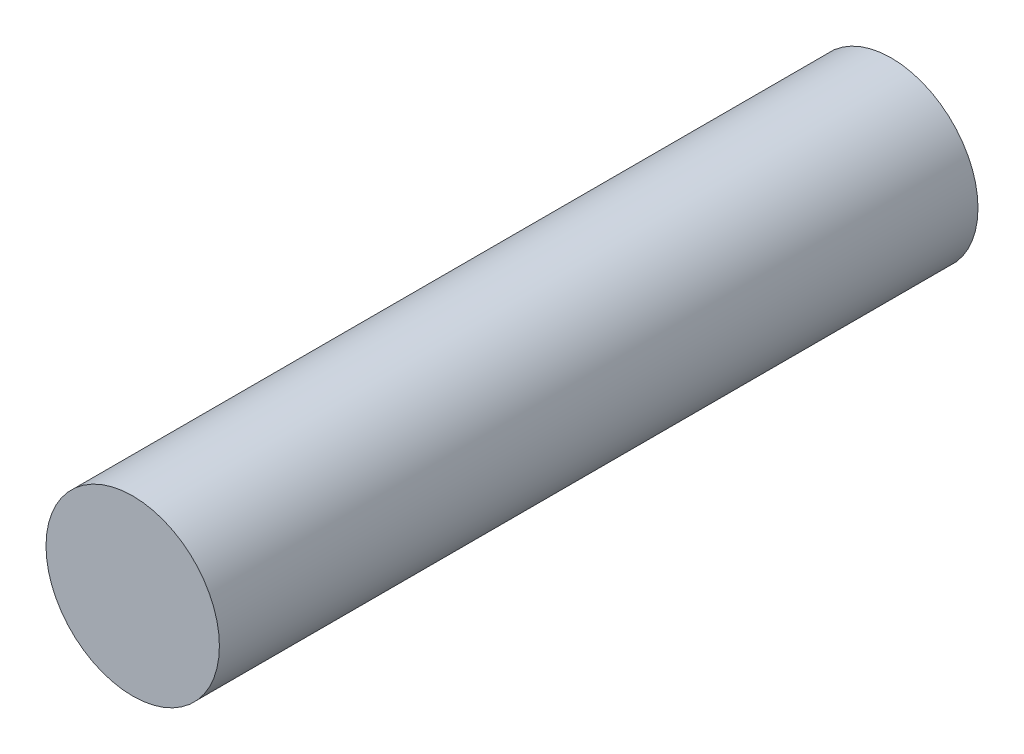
ISO-10303-21;
HEADER;
FILE_DESCRIPTION(('STEP AP214'),'2;1');
FILE_NAME('part.step','',(''),(''),'','','');
FILE_SCHEMA(('AUTOMOTIVE_DESIGN { 1 0 10303 214 1 1 1 1 }'));
ENDSEC;
DATA;
#1=APPLICATION_CONTEXT('core data for automotive mechanical design processes');
#2=APPLICATION_PROTOCOL_DEFINITION('international standard','automotive_design',2000,#1);
#3=PRODUCT_CONTEXT('',#1,'mechanical');
#4=PRODUCT('Part','Part','',(#3));
#5=PRODUCT_RELATED_PRODUCT_CATEGORY('part','',(#4));
#6=PRODUCT_DEFINITION_FORMATION('','',#4);
#7=PRODUCT_DEFINITION_CONTEXT('part definition',#1,'design');
#8=PRODUCT_DEFINITION('design','',#6,#7);
#9=PRODUCT_DEFINITION_SHAPE('','',#8);
#10=(LENGTH_UNIT() NAMED_UNIT(*) SI_UNIT(.MILLI.,.METRE.));
#11=(NAMED_UNIT(*) PLANE_ANGLE_UNIT() SI_UNIT($,.RADIAN.));
#12=(NAMED_UNIT(*) SI_UNIT($,.STERADIAN.) SOLID_ANGLE_UNIT());
#13=UNCERTAINTY_MEASURE_WITH_UNIT(LENGTH_MEASURE(1.E-05),#10,'distance_accuracy_value','');
#14=(GEOMETRIC_REPRESENTATION_CONTEXT(3) GLOBAL_UNCERTAINTY_ASSIGNED_CONTEXT((#13)) GLOBAL_UNIT_ASSIGNED_CONTEXT((#10,
#11,#12)) REPRESENTATION_CONTEXT('',''));
#15=CARTESIAN_POINT('',(0.,0.,0.));
#16=DIRECTION('',(0.,0.,1.));
#17=DIRECTION('',(1.,0.,0.));
#18=AXIS2_PLACEMENT_3D('',#15,#16,#17);
#19=CARTESIAN_POINT('',(0.,0.,70.));
#20=DIRECTION('',(0.,0.,1.));
#21=DIRECTION('',(1.,0.,0.));
#22=AXIS2_PLACEMENT_3D('',#19,#20,#21);
#23=PLANE('',#22);
#24=CARTESIAN_POINT('',(0.,0.,70.));
#25=DIRECTION('',(0.,0.,1.));
#26=DIRECTION('',(1.,0.,0.));
#27=AXIS2_PLACEMENT_3D('',#24,#25,#26);
#28=CIRCLE('',#27,8.);
#29=CARTESIAN_POINT('',(8.,0.,70.));
#30=VERTEX_POINT('',#29);
#31=EDGE_CURVE('E10',#30,#30,#28,.T.);
#32=ORIENTED_EDGE('',*,*,#31,.T.);
#33=EDGE_LOOP('',(#32));
#34=FACE_BOUND('',#33,.T.);
#35=ADVANCED_FACE('F16',(#34),#23,.T.);
#36=CARTESIAN_POINT('',(0.,0.,0.));
#37=DIRECTION('',(0.,0.,1.));
#38=DIRECTION('',(1.,0.,0.));
#39=AXIS2_PLACEMENT_3D('',#36,#37,#38);
#40=PLANE('',#39);
#41=CARTESIAN_POINT('',(0.,0.,0.));
#42=DIRECTION('',(0.,0.,1.));
#43=DIRECTION('',(1.,0.,0.));
#44=AXIS2_PLACEMENT_3D('',#41,#42,#43);
#45=CIRCLE('',#44,8.);
#46=CARTESIAN_POINT('',(8.,0.,0.));
#47=VERTEX_POINT('',#46);
#48=EDGE_CURVE('E41',#47,#47,#45,.T.);
#49=ORIENTED_EDGE('',*,*,#48,.F.);
#50=EDGE_LOOP('',(#49));
#51=FACE_BOUND('',#50,.T.);
#52=ADVANCED_FACE('F55',(#51),#40,.F.);
#53=CARTESIAN_POINT('',(0.,0.,0.));
#54=DIRECTION('',(0.,0.,-1.));
#55=DIRECTION('',(1.,0.,0.));
#56=AXIS2_PLACEMENT_3D('',#53,#54,#55);
#57=CYLINDRICAL_SURFACE('',#56,8.);
#58=ORIENTED_EDGE('',*,*,#48,.T.);
#59=DIRECTION('',(0.,0.,1.));
#60=VECTOR('',#59,1.);
#61=CARTESIAN_POINT('',(8.,0.,0.));
#62=LINE('',#61,#60);
#63=EDGE_CURVE('E24',#47,#30,#62,.T.);
#64=ORIENTED_EDGE('',*,*,#63,.T.);
#65=ORIENTED_EDGE('',*,*,#31,.F.);
#66=ORIENTED_EDGE('',*,*,#63,.F.);
#67=EDGE_LOOP('',(#58,#64,#65,#66));
#68=FACE_BOUND('',#67,.T.);
#69=ADVANCED_FACE('F39',(#68),#57,.T.);
#70=CLOSED_SHELL('',(#35,#52,#69));
#71=MANIFOLD_SOLID_BREP('B1',#70);
#72=ADVANCED_BREP_SHAPE_REPRESENTATION('',(#18,#71),#14);
#73=SHAPE_DEFINITION_REPRESENTATION(#9,#72);
ENDSEC;
END-ISO-10303-21;
